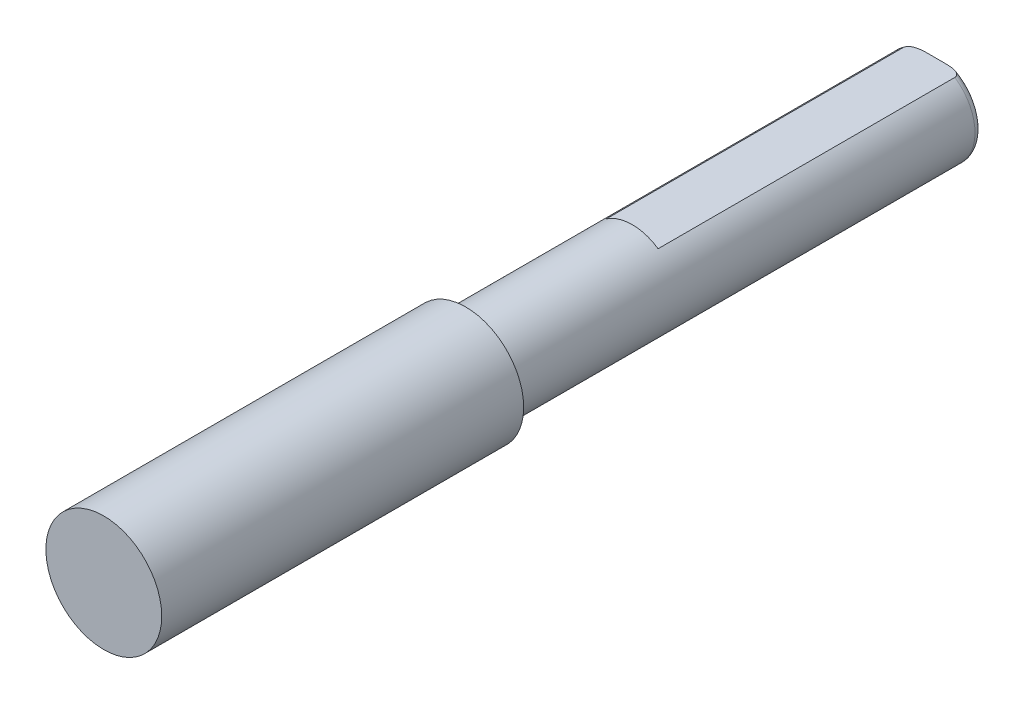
from build123d import *

# Parameters (mm, degrees)
SKETCH_2_R          = 3.175
EXTRUDE_1_DEPTH     = 32.5
SKETCH_3_R          = 4
EXTRUDE_2_DEPTH     = 25
CUT_EXTRUDE_1_DEPTH = 21
FILLET_1_R          = 0.5


with BuildPart() as part:
    # Sketch 2 → Extrude 1 (new body)
    with BuildSketch(Plane.XY):
        Circle(SKETCH_2_R)
    extrude(amount=EXTRUDE_1_DEPTH)

    # Sketch 3 → Extrude 2 (add)
    with BuildSketch(Plane.XY.offset(32.5)):
        Circle(SKETCH_3_R)
    extrude(amount=EXTRUDE_2_DEPTH)

    # Sketch 4 → Cut-Extrude 1 (cut)
    with BuildSketch(Plane(origin=(0, 0, 0), x_dir=(-1, 0, 0), z_dir=(0, 0, -1))):
        with BuildLine():
            Line((-1.78605711, 2.625), (1.78605711, 2.625))
            ThreePointArc((1.78605711, 2.625), (0, 3.175), (-1.78605711, 2.625))
        make_face()
    extrude(amount=-CUT_EXTRUDE_1_DEPTH, mode=Mode.SUBTRACT)

    # Fillet 1
    fillet_1_edges = [part.edges().sort_by_distance(p)[0] for p in [
        (-1.48490634, -2.806363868, 0),
    ]]
    fillet(fillet_1_edges, radius=FILLET_1_R)


solid = part.part
